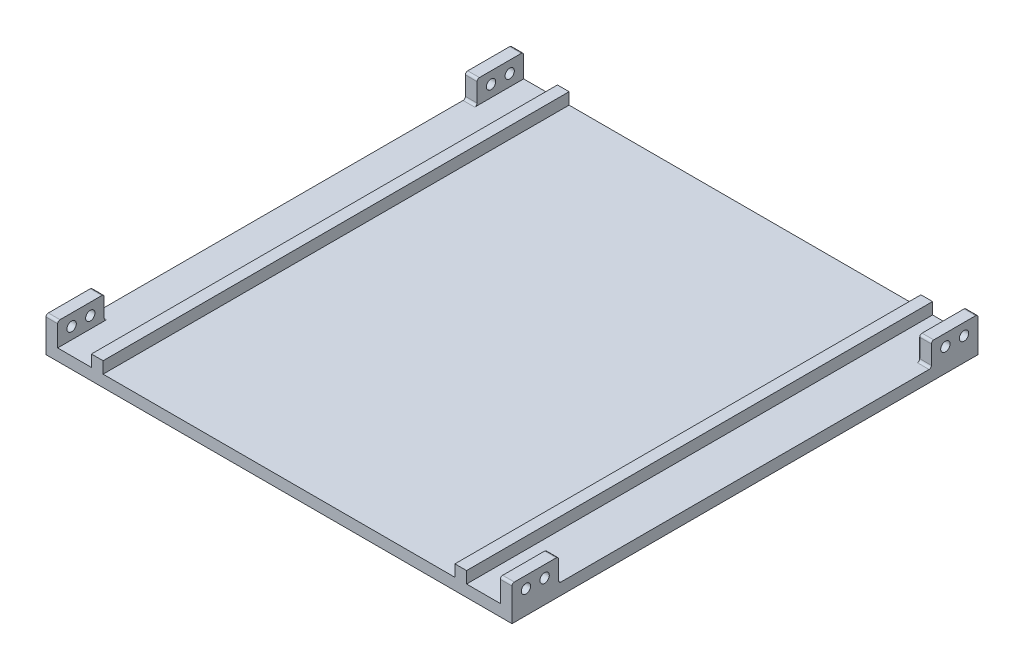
from build123d import *

# Parameters (mm, degrees)
SKETCH1_W            = 200
SKETCH1_H            = 5
BOSS_EXTRUDE1_DEPTH  = 100
SKETCH2_W            = 5
SKETCH2_H            = 200
BOSS_EXTRUDE2_DEPTH  = 5
SKETCH3_W            = 5
SKETCH3_H            = 20
BOSS_EXTRUDE3_DEPTH  = 10
SKETCH4_R            = 2
CUT_EXTRUDE1_DEPTH   = 10
FILLET1_R            = 1
FILLET1_OF_MIRROR1_R = 1


with BuildPart() as part:
    # Sketch1 → Boss-Extrude1 (new, symmetric)
    with BuildSketch(Plane.XY):
        with Locations((0, -2.5)):
            Rectangle(SKETCH1_W, SKETCH1_H)
    extrude(amount=BOSS_EXTRUDE1_DEPTH, both=True)

    # Sketch2 → Boss-Extrude2 (add)
    with BuildSketch(Plane(origin=(0, 0, 0), x_dir=(1, 0, 0), z_dir=(0, 1, 0))):
        with Locations((-78, 0)):
            Rectangle(SKETCH2_W, SKETCH2_H)
        with Locations((78, 0)):
            Rectangle(SKETCH2_W, SKETCH2_H)
    extrude(amount=BOSS_EXTRUDE2_DEPTH)

    # Sketch3 → Boss-Extrude3 (add)
    with BuildSketch(Plane(origin=(0, 0, 0), x_dir=(1, 0, 0), z_dir=(0, 1, 0))):
        with Locations((-97.5, -90)):
            Rectangle(SKETCH3_W, SKETCH3_H)
        with Locations((-97.5, 90)):
            Rectangle(SKETCH3_W, SKETCH3_H)
    boss_extrude3 = extrude(amount=BOSS_EXTRUDE3_DEPTH)

    # Sketch4 → Cut-Extrude1 (cut)
    with BuildSketch(Plane.ZY.offset(100)):
        with Locations((-86, 5)):
            Circle(SKETCH4_R)
        with Locations((-94, 5)):
            Circle(SKETCH4_R)
        with Locations((94, 5)):
            Circle(SKETCH4_R)
        with Locations((86, 5)):
            Circle(SKETCH4_R)
        with Locations((-86, 5)):
            Circle(SKETCH4_R)
        with Locations((-94, 5)):
            Circle(SKETCH4_R)
    cut_extrude1 = extrude(amount=-CUT_EXTRUDE1_DEPTH, mode=Mode.SUBTRACT)

    # Fillet1
    fillet1_edges = [part.edges().sort_by_distance(p)[0] for p in [
        (-97.5, 0, 80),
        (-97.5, 10, 100),
        (-97.5, 10, 80),
        (-97.5, 0, -80),
        (-97.5, 10, -100),
        (-97.5, 10, -80),
    ]]
    fillet(fillet1_edges, radius=FILLET1_R)

    # Mirror1: Boss-Extrude3, Cut-Extrude1 across plane
    add(boss_extrude3.mirror(Plane(origin=(0, 0, 0), x_dir=(0, 0, 1), z_dir=(1, 0, 0))))
    add(cut_extrude1.mirror(Plane(origin=(0, 0, 0), x_dir=(0, 0, 1), z_dir=(1, 0, 0))), mode=Mode.SUBTRACT)

    # Fillet1 of Mirror1
    fillet1_of_mirror1_edges = [part.edges().sort_by_distance(p)[0] for p in [
        (97.5, 0, 80),
        (97.5, 10, 100),
        (97.5, 10, 80),
        (97.5, 0, -80),
        (97.5, 10, -100),
        (97.5, 10, -80),
    ]]
    fillet(fillet1_of_mirror1_edges, radius=FILLET1_OF_MIRROR1_R)


solid = part.part
